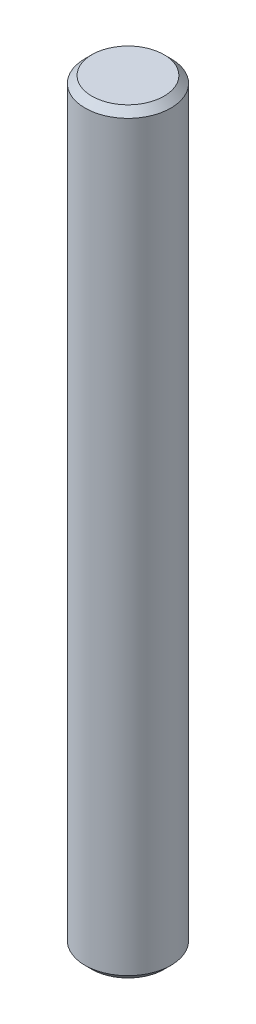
from build123d import *

# Parameters (mm, degrees)
SKETCH1_R      = 1.5875
EXTRUDE1_DEPTH = 13.9954
CHAMFER1_SIZE  = 0.254


with BuildPart() as part:
    # Sketch1 → Extrude1 (new, symmetric)
    with BuildSketch(Plane(origin=(0, 0, 0), x_dir=(1, 0, 0), z_dir=(0, 1, 0))):
        with Locations(Location((0, 0, 0), (0, 0, 270))):
            Circle(SKETCH1_R)
    extrude(amount=EXTRUDE1_DEPTH, both=True)

    # Chamfer1
    chamfer1_edges = [part.edges().sort_by_distance(p)[0] for p in [
        (0, -13.9954, -1.5875),
        (0, 13.9954, -1.5875),
    ]]
    chamfer(chamfer1_edges, length=CHAMFER1_SIZE)


solid = part.part
